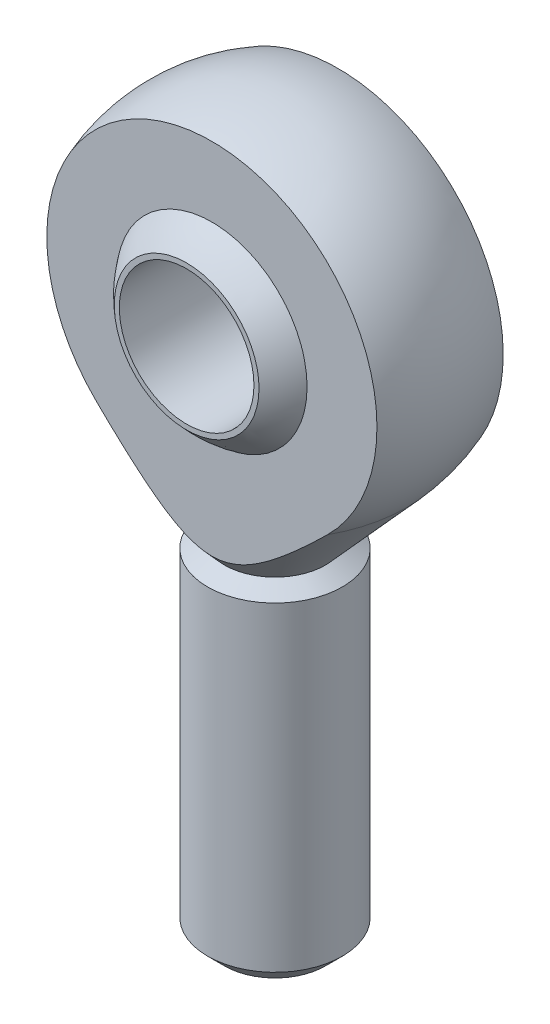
ISO-10303-21;
HEADER;
FILE_DESCRIPTION(('STEP AP214'),'2;1');
FILE_NAME('part.step','',(''),(''),'','','');
FILE_SCHEMA(('AUTOMOTIVE_DESIGN { 1 0 10303 214 1 1 1 1 }'));
ENDSEC;
DATA;
#1=APPLICATION_CONTEXT('core data for automotive mechanical design processes');
#2=APPLICATION_PROTOCOL_DEFINITION('international standard','automotive_design',2000,#1);
#3=PRODUCT_CONTEXT('',#1,'mechanical');
#4=PRODUCT('Part','Part','',(#3));
#5=PRODUCT_RELATED_PRODUCT_CATEGORY('part','',(#4));
#6=PRODUCT_DEFINITION_FORMATION('','',#4);
#7=PRODUCT_DEFINITION_CONTEXT('part definition',#1,'design');
#8=PRODUCT_DEFINITION('design','',#6,#7);
#9=PRODUCT_DEFINITION_SHAPE('','',#8);
#10=(LENGTH_UNIT() NAMED_UNIT(*) SI_UNIT(.MILLI.,.METRE.));
#11=(NAMED_UNIT(*) PLANE_ANGLE_UNIT() SI_UNIT($,.RADIAN.));
#12=(NAMED_UNIT(*) SI_UNIT($,.STERADIAN.) SOLID_ANGLE_UNIT());
#13=UNCERTAINTY_MEASURE_WITH_UNIT(LENGTH_MEASURE(1.E-05),#10,'distance_accuracy_value','');
#14=(GEOMETRIC_REPRESENTATION_CONTEXT(3) GLOBAL_UNCERTAINTY_ASSIGNED_CONTEXT((#13)) GLOBAL_UNIT_ASSIGNED_CONTEXT((#10,
#11,#12)) REPRESENTATION_CONTEXT('',''));
#15=CARTESIAN_POINT('',(0.,0.,0.));
#16=DIRECTION('',(0.,0.,1.));
#17=DIRECTION('',(1.,0.,0.));
#18=AXIS2_PLACEMENT_3D('',#15,#16,#17);
#19=CARTESIAN_POINT('',(0.,0.,0.));
#20=DIRECTION('',(0.,0.,1.));
#21=DIRECTION('',(-1.,0.,0.));
#22=AXIS2_PLACEMENT_3D('',#19,#20,#21);
#23=SPHERICAL_SURFACE('',#22,13.573125);
#24=CARTESIAN_POINT('',(0.,0.,-7.5));
#25=DIRECTION('',(0.,0.,1.));
#26=DIRECTION('',(1.,0.,0.));
#27=AXIS2_PLACEMENT_3D('',#24,#25,#26);
#28=CIRCLE('',#27,11.3128123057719);
#29=CARTESIAN_POINT('',(11.3128123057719,0.,-7.5));
#30=VERTEX_POINT('',#29);
#31=EDGE_CURVE('P0_E52',#30,#30,#28,.T.);
#32=ORIENTED_EDGE('',*,*,#31,.F.);
#33=EDGE_LOOP('',(#32));
#34=FACE_BOUND('',#33,.T.);
#35=CARTESIAN_POINT('',(0.,0.,7.5));
#36=DIRECTION('',(0.,0.,1.));
#37=DIRECTION('',(1.,0.,0.));
#38=AXIS2_PLACEMENT_3D('',#35,#36,#37);
#39=CIRCLE('',#38,11.3128123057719);
#40=CARTESIAN_POINT('',(11.3128123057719,0.,7.5));
#41=VERTEX_POINT('',#40);
#42=EDGE_CURVE('P0_E20',#41,#41,#39,.F.);
#43=ORIENTED_EDGE('',*,*,#42,.F.);
#44=EDGE_LOOP('',(#43));
#45=FACE_BOUND('',#44,.T.);
#46=ADVANCED_FACE('P0_F16',(#34,#45),#23,.F.);
#47=CARTESIAN_POINT('',(19.615045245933,-27.4229794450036,7.5));
#48=CARTESIAN_POINT('',(19.615045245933,19.615045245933,7.5));
#49=CARTESIAN_POINT('',(19.615045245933,20.0854254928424,7.5));
#50=B_SPLINE_CURVE_WITH_KNOTS('',1,(#47,#48,#49),.UNSPECIFIED.,.F.,.F.,(2,1,2),(0.,1.,1.01),.UNSPECIFIED.);
#51=DIRECTION('',(-1.,0.,0.));
#52=VECTOR('',#51,1.);
#53=SURFACE_OF_LINEAR_EXTRUSION('',#50,#52);
#54=ORIENTED_EDGE('',*,*,#42,.T.);
#55=EDGE_LOOP('',(#54));
#56=FACE_BOUND('',#55,.T.);
#57=CARTESIAN_POINT('',(0.,0.,7.5));
#58=DIRECTION('',(0.,0.,1.));
#59=DIRECTION('',(1.,0.,0.));
#60=AXIS2_PLACEMENT_3D('',#57,#58,#59);
#61=CIRCLE('',#60,19.615045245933);
#62=CARTESIAN_POINT('',(-13.7077850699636,-14.0302041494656,7.5));
#63=VERTEX_POINT('',#62);
#64=CARTESIAN_POINT('',(13.7077850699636,-14.0302041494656,7.5));
#65=VERTEX_POINT('',#64);
#66=EDGE_CURVE('P0_E47',#63,#65,#61,.F.);
#67=ORIENTED_EDGE('',*,*,#66,.F.);
#68=CARTESIAN_POINT('',(13.7077850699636,-14.0302041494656,7.5));
#69=CARTESIAN_POINT('',(13.5201011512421,-14.2135691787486,7.5));
#70=CARTESIAN_POINT('',(13.3319885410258,-14.3964967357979,7.5));
#71=CARTESIAN_POINT('',(12.9547503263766,-14.7614000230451,7.5));
#72=CARTESIAN_POINT('',(12.7656244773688,-14.9433755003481,7.5));
#73=CARTESIAN_POINT('',(12.386271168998,-15.3062314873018,7.5));
#74=CARTESIAN_POINT('',(12.196043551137,-15.4871118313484,7.5));
#75=CARTESIAN_POINT('',(11.8143748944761,-15.8476092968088,7.5));
#76=CARTESIAN_POINT('',(11.6229337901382,-16.0272263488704,7.5));
#77=CARTESIAN_POINT('',(11.2368516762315,-16.3867306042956,7.5));
#78=CARTESIAN_POINT('',(11.0421976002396,-16.5666037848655,7.5));
#79=CARTESIAN_POINT('',(10.6513449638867,-16.9246409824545,7.5));
#80=CARTESIAN_POINT('',(10.4551465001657,-17.1028051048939,7.5));
#81=CARTESIAN_POINT('',(10.0609995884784,-17.4571570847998,7.5));
#82=CARTESIAN_POINT('',(9.86305128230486,-17.6333450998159,7.5));
#83=CARTESIAN_POINT('',(9.46515388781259,-17.9834261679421,7.5));
#84=CARTESIAN_POINT('',(9.26520491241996,-18.1573193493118,7.5));
#85=CARTESIAN_POINT('',(8.81669783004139,-18.5421628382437,7.5));
#86=CARTESIAN_POINT('',(8.56754845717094,-18.7524259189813,7.5));
#87=CARTESIAN_POINT('',(8.06509071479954,-19.1679834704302,7.5));
#88=CARTESIAN_POINT('',(7.81178196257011,-19.3732774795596,7.5));
#89=CARTESIAN_POINT('',(7.3001126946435,-19.7777167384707,7.5));
#90=CARTESIAN_POINT('',(7.04175010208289,-19.9768593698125,7.5));
#91=CARTESIAN_POINT('',(6.51970723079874,-20.3667620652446,7.5));
#92=CARTESIAN_POINT('',(6.25604112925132,-20.5575410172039,7.5));
#93=CARTESIAN_POINT('',(5.72169518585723,-20.9288768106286,7.5));
#94=CARTESIAN_POINT('',(5.45101764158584,-21.1094369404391,7.5));
#95=CARTESIAN_POINT('',(4.90132851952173,-21.4571693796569,7.5));
#96=CARTESIAN_POINT('',(4.62232208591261,-21.6243497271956,7.5));
#97=CARTESIAN_POINT('',(4.13119330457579,-21.8982136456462,7.5));
#98=CARTESIAN_POINT('',(3.92138501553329,-22.0090320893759,7.5));
#99=CARTESIAN_POINT('',(3.49596072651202,-22.2190464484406,7.5));
#100=CARTESIAN_POINT('',(3.28034436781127,-22.3182416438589,7.5));
#101=CARTESIAN_POINT('',(2.84339250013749,-22.5021599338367,7.5));
#102=CARTESIAN_POINT('',(2.62206718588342,-22.5869070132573,7.5));
#103=CARTESIAN_POINT('',(2.17353927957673,-22.7390123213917,7.5));
#104=CARTESIAN_POINT('',(1.94633943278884,-22.8063785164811,7.5));
#105=CARTESIAN_POINT('',(1.52448409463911,-22.9111980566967,7.5));
#106=CARTESIAN_POINT('',(1.33060123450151,-22.951745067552,7.5));
#107=CARTESIAN_POINT('',(0.940151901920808,-23.0168263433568,7.5));
#108=CARTESIAN_POINT('',(0.743585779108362,-23.0413626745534,7.5));
#109=CARTESIAN_POINT('',(0.349313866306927,-23.0732614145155,7.5));
#110=CARTESIAN_POINT('',(0.151609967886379,-23.0806469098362,7.5));
#111=CARTESIAN_POINT('',(-0.243681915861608,-23.0779449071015,7.5));
#112=CARTESIAN_POINT('',(-0.441269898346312,-23.0678569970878,7.5));
#113=CARTESIAN_POINT('',(-0.834207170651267,-23.0307646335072,7.5));
#114=CARTESIAN_POINT('',(-1.02956151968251,-23.0038130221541,7.5));
#115=CARTESIAN_POINT('',(-1.41744209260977,-22.9342653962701,7.5));
#116=CARTESIAN_POINT('',(-1.60996813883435,-22.8916684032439,7.5));
#117=CARTESIAN_POINT('',(-1.99173123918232,-22.7924143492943,7.5));
#118=CARTESIAN_POINT('',(-2.18096098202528,-22.7357294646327,7.5));
#119=CARTESIAN_POINT('',(-2.55529723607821,-22.6102044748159,7.5));
#120=CARTESIAN_POINT('',(-2.74040383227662,-22.541364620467,7.5));
#121=CARTESIAN_POINT('',(-3.15766109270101,-22.372602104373,7.5));
#122=CARTESIAN_POINT('',(-3.38846959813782,-22.2693735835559,7.5));
#123=CARTESIAN_POINT('',(-3.84367093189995,-22.0492107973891,7.5));
#124=CARTESIAN_POINT('',(-4.0680567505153,-21.9322622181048,7.5));
#125=CARTESIAN_POINT('',(-4.5110690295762,-21.6873166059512,7.5));
#126=CARTESIAN_POINT('',(-4.72968729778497,-21.5593048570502,7.5));
#127=CARTESIAN_POINT('',(-5.16157771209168,-21.2945153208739,7.5));
#128=CARTESIAN_POINT('',(-5.37484874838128,-21.1577357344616,7.5));
#129=CARTESIAN_POINT('',(-5.7988625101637,-20.8756706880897,7.5));
#130=CARTESIAN_POINT('',(-6.00955618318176,-20.7303118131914,7.5));
#131=CARTESIAN_POINT('',(-6.42655166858,-20.433901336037,7.5));
#132=CARTESIAN_POINT('',(-6.63285786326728,-20.2828558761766,7.5));
#133=CARTESIAN_POINT('',(-7.04177902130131,-19.9760392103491,7.5));
#134=CARTESIAN_POINT('',(-7.24439551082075,-19.8202700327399,7.5));
#135=CARTESIAN_POINT('',(-7.64648838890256,-19.5047777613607,7.5));
#136=CARTESIAN_POINT('',(-7.84596507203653,-19.3450550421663,7.5));
#137=CARTESIAN_POINT('',(-8.24508039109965,-19.0199476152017,7.5));
#138=CARTESIAN_POINT('',(-8.44467943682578,-18.8545143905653,7.5));
#139=CARTESIAN_POINT('',(-8.84147600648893,-18.5207449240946,7.5));
#140=CARTESIAN_POINT('',(-9.03867321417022,-18.3524083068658,7.5));
#141=CARTESIAN_POINT('',(-9.43098412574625,-18.0132525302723,7.5));
#142=CARTESIAN_POINT('',(-9.62609742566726,-17.8424329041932,7.5));
#143=CARTESIAN_POINT('',(-10.0144974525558,-17.4986624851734,7.5));
#144=CARTESIAN_POINT('',(-10.207783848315,-17.3257113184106,7.5));
#145=CARTESIAN_POINT('',(-10.5927390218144,-16.9779746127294,7.5));
#146=CARTESIAN_POINT('',(-10.7844076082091,-16.8031888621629,7.5));
#147=CARTESIAN_POINT('',(-11.1604566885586,-16.4574070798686,7.5));
#148=CARTESIAN_POINT('',(-11.3448808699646,-16.2864585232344,7.5));
#149=CARTESIAN_POINT('',(-11.7124965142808,-15.9432753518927,7.5));
#150=CARTESIAN_POINT('',(-11.8956880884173,-15.7710408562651,7.5));
#151=CARTESIAN_POINT('',(-12.2609396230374,-15.4254638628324,7.5));
#152=CARTESIAN_POINT('',(-12.4429998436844,-15.252121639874,7.5));
#153=CARTESIAN_POINT('',(-12.8060716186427,-14.9044883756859,7.5));
#154=CARTESIAN_POINT('',(-12.9870835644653,-14.730197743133,7.5));
#155=CARTESIAN_POINT('',(-13.3481227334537,-14.3808062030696,7.5));
#156=CARTESIAN_POINT('',(-13.5281504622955,-14.2057058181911,7.5));
#157=CARTESIAN_POINT('',(-13.7077850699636,-14.0302041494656,7.5));
#158=B_SPLINE_CURVE_WITH_KNOTS('',3,(#68,#69,#70,#71,#72,#73,#74,#75,#76,#77,#78,#79,#80,#81,
#82,#83,#84,#85,#86,#87,#88,#89,#90,#91,#92,#93,#94,#95,#96,#97,#98,#99,#100,#101,#102,#103,
#104,#105,#106,#107,#108,#109,#110,#111,#112,#113,#114,#115,#116,#117,#118,#119,#120,#121,#122,
#123,#124,#125,#126,#127,#128,#129,#130,#131,#132,#133,#134,#135,#136,#137,#138,#139,#140,#141,
#142,#143,#144,#145,#146,#147,#148,#149,#150,#151,#152,#153,#154,#155,#156,#157),.UNSPECIFIED.,
.F.,.F.,(4,2,2,2,2,2,2,2,2,2,2,2,2,2,2,2,2,2,2,2,2,2,2,2,2,2,2,2,2,2,2,2,2,2,2,2,2,2,2,2,2,2,2,
2,4),(0.,0.787167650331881,1.57453473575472,2.362018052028,3.14954426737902,3.94464626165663,
4.73969889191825,5.53468767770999,6.32963184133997,7.30762431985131,8.28570729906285,
9.26420103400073,10.2403573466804,11.2161977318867,12.1914473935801,12.902993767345,
13.6145841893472,14.3249815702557,15.0350527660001,15.6286868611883,16.2222443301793,
16.8150023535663,17.4077743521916,17.9986981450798,18.5896589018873,19.1817962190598,
19.7739213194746,20.5318638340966,21.2906042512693,22.0503699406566,22.8102920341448,
23.5780835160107,24.3450682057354,25.1117280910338,25.8783156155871,26.6560184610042,
27.4338226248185,28.2117749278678,28.9898656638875,29.7680471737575,30.5224413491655,
31.2767665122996,32.0309112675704,32.784753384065,33.5381627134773),.UNSPECIFIED.);
#159=EDGE_CURVE('P0_E50',#65,#63,#158,.T.);
#160=ORIENTED_EDGE('',*,*,#159,.F.);
#161=EDGE_LOOP('',(#67,#160));
#162=FACE_BOUND('',#161,.T.);
#163=ADVANCED_FACE('P0_F49',(#56,#162),#53,.T.);
#164=CARTESIAN_POINT('',(19.615045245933,20.0854254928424,-7.5));
#165=CARTESIAN_POINT('',(19.615045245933,19.615045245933,-7.5));
#166=CARTESIAN_POINT('',(19.615045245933,-27.4229794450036,-7.5));
#167=B_SPLINE_CURVE_WITH_KNOTS('',1,(#164,#165,#166),.UNSPECIFIED.,.F.,.F.,(2,1,2),(-0.01,0.,
1.),.UNSPECIFIED.);
#168=DIRECTION('',(-1.,0.,0.));
#169=VECTOR('',#168,1.);
#170=SURFACE_OF_LINEAR_EXTRUSION('',#167,#169);
#171=ORIENTED_EDGE('',*,*,#31,.T.);
#172=EDGE_LOOP('',(#171));
#173=FACE_BOUND('',#172,.T.);
#174=CARTESIAN_POINT('',(-13.7077850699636,-14.0302041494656,-7.5));
#175=CARTESIAN_POINT('',(-13.5201011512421,-14.2135691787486,-7.5));
#176=CARTESIAN_POINT('',(-13.3319885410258,-14.3964967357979,-7.5));
#177=CARTESIAN_POINT('',(-12.9547503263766,-14.7614000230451,-7.5));
#178=CARTESIAN_POINT('',(-12.7656244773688,-14.9433755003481,-7.5));
#179=CARTESIAN_POINT('',(-12.386271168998,-15.3062314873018,-7.5));
#180=CARTESIAN_POINT('',(-12.196043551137,-15.4871118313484,-7.5));
#181=CARTESIAN_POINT('',(-11.8143748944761,-15.8476092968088,-7.5));
#182=CARTESIAN_POINT('',(-11.6229337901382,-16.0272263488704,-7.5));
#183=CARTESIAN_POINT('',(-11.2368516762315,-16.3867306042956,-7.5));
#184=CARTESIAN_POINT('',(-11.0421976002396,-16.5666037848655,-7.5));
#185=CARTESIAN_POINT('',(-10.6513449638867,-16.9246409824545,-7.5));
#186=CARTESIAN_POINT('',(-10.4551465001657,-17.1028051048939,-7.5));
#187=CARTESIAN_POINT('',(-10.0609995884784,-17.4571570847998,-7.5));
#188=CARTESIAN_POINT('',(-9.86305128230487,-17.6333450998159,-7.5));
#189=CARTESIAN_POINT('',(-9.46515388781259,-17.9834261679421,-7.5));
#190=CARTESIAN_POINT('',(-9.26520491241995,-18.1573193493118,-7.5));
#191=CARTESIAN_POINT('',(-8.81669783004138,-18.5421628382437,-7.5));
#192=CARTESIAN_POINT('',(-8.56754845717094,-18.7524259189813,-7.5));
#193=CARTESIAN_POINT('',(-8.06509071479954,-19.1679834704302,-7.5));
#194=CARTESIAN_POINT('',(-7.81178196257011,-19.3732774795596,-7.5));
#195=CARTESIAN_POINT('',(-7.3001126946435,-19.7777167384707,-7.5));
#196=CARTESIAN_POINT('',(-7.04175010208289,-19.9768593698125,-7.5));
#197=CARTESIAN_POINT('',(-6.51970723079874,-20.3667620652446,-7.5));
#198=CARTESIAN_POINT('',(-6.25604112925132,-20.5575410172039,-7.5));
#199=CARTESIAN_POINT('',(-5.72169518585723,-20.9288768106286,-7.5));
#200=CARTESIAN_POINT('',(-5.45101764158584,-21.1094369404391,-7.5));
#201=CARTESIAN_POINT('',(-4.90132851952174,-21.4571693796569,-7.5));
#202=CARTESIAN_POINT('',(-4.62232208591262,-21.6243497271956,-7.5));
#203=CARTESIAN_POINT('',(-4.1311933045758,-21.8982136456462,-7.5));
#204=CARTESIAN_POINT('',(-3.92138501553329,-22.0090320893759,-7.5));
#205=CARTESIAN_POINT('',(-3.49596072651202,-22.2190464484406,-7.5));
#206=CARTESIAN_POINT('',(-3.28034436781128,-22.3182416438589,-7.5));
#207=CARTESIAN_POINT('',(-2.8433925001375,-22.5021599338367,-7.5));
#208=CARTESIAN_POINT('',(-2.62206718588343,-22.5869070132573,-7.5));
#209=CARTESIAN_POINT('',(-2.17353927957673,-22.7390123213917,-7.5));
#210=CARTESIAN_POINT('',(-1.94633943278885,-22.8063785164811,-7.5));
#211=CARTESIAN_POINT('',(-1.52448409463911,-22.9111980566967,-7.5));
#212=CARTESIAN_POINT('',(-1.33060123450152,-22.951745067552,-7.5));
#213=CARTESIAN_POINT('',(-0.940151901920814,-23.0168263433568,-7.5));
#214=CARTESIAN_POINT('',(-0.743585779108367,-23.0413626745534,-7.5));
#215=CARTESIAN_POINT('',(-0.349313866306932,-23.0732614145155,-7.5));
#216=CARTESIAN_POINT('',(-0.151609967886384,-23.0806469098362,-7.5));
#217=CARTESIAN_POINT('',(0.243681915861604,-23.0779449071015,-7.5));
#218=CARTESIAN_POINT('',(0.441269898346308,-23.0678569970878,-7.5));
#219=CARTESIAN_POINT('',(0.834207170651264,-23.0307646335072,-7.5));
#220=CARTESIAN_POINT('',(1.0295615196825,-23.0038130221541,-7.5));
#221=CARTESIAN_POINT('',(1.41744209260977,-22.9342653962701,-7.5));
#222=CARTESIAN_POINT('',(1.60996813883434,-22.8916684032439,-7.5));
#223=CARTESIAN_POINT('',(1.99173123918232,-22.7924143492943,-7.5));
#224=CARTESIAN_POINT('',(2.18096098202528,-22.7357294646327,-7.5));
#225=CARTESIAN_POINT('',(2.55529723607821,-22.6102044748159,-7.5));
#226=CARTESIAN_POINT('',(2.74040383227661,-22.541364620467,-7.5));
#227=CARTESIAN_POINT('',(3.15766109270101,-22.372602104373,-7.5));
#228=CARTESIAN_POINT('',(3.38846959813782,-22.2693735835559,-7.5));
#229=CARTESIAN_POINT('',(3.84367093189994,-22.0492107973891,-7.5));
#230=CARTESIAN_POINT('',(4.06805675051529,-21.9322622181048,-7.5));
#231=CARTESIAN_POINT('',(4.51106902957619,-21.6873166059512,-7.5));
#232=CARTESIAN_POINT('',(4.72968729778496,-21.5593048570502,-7.5));
#233=CARTESIAN_POINT('',(5.16157771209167,-21.294515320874,-7.5));
#234=CARTESIAN_POINT('',(5.37484874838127,-21.1577357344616,-7.5));
#235=CARTESIAN_POINT('',(5.79886251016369,-20.8756706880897,-7.5));
#236=CARTESIAN_POINT('',(6.00955618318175,-20.7303118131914,-7.5));
#237=CARTESIAN_POINT('',(6.42655166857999,-20.433901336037,-7.5));
#238=CARTESIAN_POINT('',(6.63285786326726,-20.2828558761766,-7.5));
#239=CARTESIAN_POINT('',(7.04177902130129,-19.9760392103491,-7.5));
#240=CARTESIAN_POINT('',(7.24439551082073,-19.82027003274,-7.5));
#241=CARTESIAN_POINT('',(7.64648838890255,-19.5047777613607,-7.5));
#242=CARTESIAN_POINT('',(7.84596507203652,-19.3450550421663,-7.5));
#243=CARTESIAN_POINT('',(8.24508039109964,-19.0199476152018,-7.5));
#244=CARTESIAN_POINT('',(8.44467943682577,-18.8545143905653,-7.5));
#245=CARTESIAN_POINT('',(8.84147600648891,-18.5207449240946,-7.5));
#246=CARTESIAN_POINT('',(9.0386732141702,-18.3524083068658,-7.5));
#247=CARTESIAN_POINT('',(9.43098412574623,-18.0132525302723,-7.5));
#248=CARTESIAN_POINT('',(9.62609742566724,-17.8424329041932,-7.5));
#249=CARTESIAN_POINT('',(10.0144974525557,-17.4986624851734,-7.5));
#250=CARTESIAN_POINT('',(10.207783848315,-17.3257113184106,-7.5));
#251=CARTESIAN_POINT('',(10.5927390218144,-16.9779746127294,-7.5));
#252=CARTESIAN_POINT('',(10.784407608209,-16.8031888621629,-7.5));
#253=CARTESIAN_POINT('',(11.1604566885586,-16.4574070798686,-7.5));
#254=CARTESIAN_POINT('',(11.3448808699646,-16.2864585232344,-7.5));
#255=CARTESIAN_POINT('',(11.7124965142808,-15.9432753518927,-7.5));
#256=CARTESIAN_POINT('',(11.8956880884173,-15.7710408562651,-7.5));
#257=CARTESIAN_POINT('',(12.2609396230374,-15.4254638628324,-7.5));
#258=CARTESIAN_POINT('',(12.4429998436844,-15.252121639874,-7.5));
#259=CARTESIAN_POINT('',(12.8060716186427,-14.9044883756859,-7.5));
#260=CARTESIAN_POINT('',(12.9870835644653,-14.730197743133,-7.5));
#261=CARTESIAN_POINT('',(13.3481227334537,-14.3808062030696,-7.5));
#262=CARTESIAN_POINT('',(13.5281504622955,-14.205705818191,-7.5));
#263=CARTESIAN_POINT('',(13.7077850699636,-14.0302041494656,-7.5));
#264=B_SPLINE_CURVE_WITH_KNOTS('',3,(#174,#175,#176,#177,#178,#179,#180,#181,#182,#183,#184,
#185,#186,#187,#188,#189,#190,#191,#192,#193,#194,#195,#196,#197,#198,#199,#200,#201,#202,#203,
#204,#205,#206,#207,#208,#209,#210,#211,#212,#213,#214,#215,#216,#217,#218,#219,#220,#221,#222,
#223,#224,#225,#226,#227,#228,#229,#230,#231,#232,#233,#234,#235,#236,#237,#238,#239,#240,#241,
#242,#243,#244,#245,#246,#247,#248,#249,#250,#251,#252,#253,#254,#255,#256,#257,#258,#259,#260,
#261,#262,#263),.UNSPECIFIED.,.F.,.F.,(4,2,2,2,2,2,2,2,2,2,2,2,2,2,2,2,2,2,2,2,2,2,2,2,2,2,2,2,
2,2,2,2,2,2,2,2,2,2,2,2,2,2,2,2,4),(0.,0.787167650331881,1.57453473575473,2.362018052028,
3.14954426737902,3.94464626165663,4.73969889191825,5.53468767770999,6.32963184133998,
7.30762431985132,8.28570729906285,9.26420103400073,10.2403573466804,11.2161977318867,
12.1914473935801,12.902993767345,13.6145841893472,14.3249815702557,15.0350527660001,
15.6286868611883,16.2222443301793,16.8150023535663,17.4077743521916,17.9986981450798,
18.5896589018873,19.1817962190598,19.7739213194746,20.5318638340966,21.2906042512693,
22.0503699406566,22.8102920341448,23.5780835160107,24.3450682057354,25.1117280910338,
25.8783156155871,26.6560184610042,27.4338226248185,28.2117749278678,28.9898656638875,
29.7680471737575,30.5224413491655,31.2767665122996,32.0309112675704,32.784753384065,
33.5381627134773),.UNSPECIFIED.);
#265=CARTESIAN_POINT('',(-13.7077850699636,-14.0302041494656,-7.5));
#266=VERTEX_POINT('',#265);
#267=CARTESIAN_POINT('',(13.7077850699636,-14.0302041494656,-7.5));
#268=VERTEX_POINT('',#267);
#269=EDGE_CURVE('P0_E57',#266,#268,#264,.T.);
#270=ORIENTED_EDGE('',*,*,#269,.F.);
#271=CARTESIAN_POINT('',(0.,0.,-7.49999999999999));
#272=DIRECTION('',(0.,0.,1.));
#273=DIRECTION('',(1.,0.,0.));
#274=AXIS2_PLACEMENT_3D('',#271,#272,#273);
#275=CIRCLE('',#274,19.615045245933);
#276=EDGE_CURVE('P0_E34',#268,#266,#275,.T.);
#277=ORIENTED_EDGE('',*,*,#276,.F.);
#278=EDGE_LOOP('',(#270,#277));
#279=FACE_BOUND('',#278,.T.);
#280=ADVANCED_FACE('P0_F75',(#173,#279),#170,.T.);
#281=CARTESIAN_POINT('',(0.,0.,0.));
#282=DIRECTION('',(0.,0.,1.));
#283=DIRECTION('',(1.,0.,0.));
#284=AXIS2_PLACEMENT_3D('',#281,#282,#283);
#285=SPHERICAL_SURFACE('',#284,21.);
#286=CARTESIAN_POINT('',(0.,-14.0302041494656,0.));
#287=DIRECTION('',(0.,1.,0.));
#288=DIRECTION('',(0.,0.,1.));
#289=AXIS2_PLACEMENT_3D('',#286,#287,#288);
#290=CIRCLE('',#289,15.6254078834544);
#291=EDGE_CURVE('P0_E42',#268,#65,#290,.F.);
#292=ORIENTED_EDGE('',*,*,#291,.F.);
#293=ORIENTED_EDGE('',*,*,#276,.T.);
#294=CARTESIAN_POINT('',(0.,-14.0302041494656,0.));
#295=DIRECTION('',(0.,1.,0.));
#296=DIRECTION('',(0.,0.,1.));
#297=AXIS2_PLACEMENT_3D('',#294,#295,#296);
#298=CIRCLE('',#297,15.6254078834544);
#299=EDGE_CURVE('P0_E55',#63,#266,#298,.F.);
#300=ORIENTED_EDGE('',*,*,#299,.F.);
#301=ORIENTED_EDGE('',*,*,#66,.T.);
#302=EDGE_LOOP('',(#292,#293,#300,#301));
#303=FACE_BOUND('',#302,.T.);
#304=ADVANCED_FACE('P0_F56',(#303),#285,.T.);
#305=CARTESIAN_POINT('',(0.,-24.75,0.));
#306=DIRECTION('',(0.,1.,0.));
#307=DIRECTION('',(0.,0.,1.));
#308=AXIS2_PLACEMENT_3D('',#305,#306,#307);
#309=CONICAL_SURFACE('',#308,6.,0.731658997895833);
#310=ORIENTED_EDGE('',*,*,#159,.T.);
#311=ORIENTED_EDGE('',*,*,#299,.T.);
#312=ORIENTED_EDGE('',*,*,#269,.T.);
#313=ORIENTED_EDGE('',*,*,#291,.T.);
#314=EDGE_LOOP('',(#310,#311,#312,#313));
#315=FACE_BOUND('',#314,.T.);
#316=CARTESIAN_POINT('',(0.,-24.75,0.));
#317=DIRECTION('',(0.,1.,0.));
#318=DIRECTION('',(0.,0.,1.));
#319=AXIS2_PLACEMENT_3D('',#316,#317,#318);
#320=CIRCLE('',#319,6.);
#321=CARTESIAN_POINT('',(0.,-24.75,6.));
#322=VERTEX_POINT('',#321);
#323=EDGE_CURVE('P0_E91',#322,#322,#320,.F.);
#324=ORIENTED_EDGE('',*,*,#323,.F.);
#325=EDGE_LOOP('',(#324));
#326=FACE_BOUND('',#325,.T.);
#327=ADVANCED_FACE('P0_F59',(#315,#326),#309,.T.);
#328=CARTESIAN_POINT('',(0.,-24.75,0.));
#329=DIRECTION('',(0.,-1.,0.));
#330=DIRECTION('',(1.,0.,0.));
#331=AXIS2_PLACEMENT_3D('',#328,#329,#330);
#332=CONICAL_SURFACE('',#331,6.,1.01219701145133);
#333=ORIENTED_EDGE('',*,*,#323,.T.);
#334=EDGE_LOOP('',(#333));
#335=FACE_BOUND('',#334,.T.);
#336=CARTESIAN_POINT('',(0.,-26.,0.));
#337=DIRECTION('',(0.,-1.,0.));
#338=DIRECTION('',(0.,0.,1.));
#339=AXIS2_PLACEMENT_3D('',#336,#337,#338);
#340=CIRCLE('',#339,8.);
#341=CARTESIAN_POINT('',(0.,-26.,8.));
#342=VERTEX_POINT('',#341);
#343=EDGE_CURVE('P0_E132',#342,#342,#340,.T.);
#344=ORIENTED_EDGE('',*,*,#343,.F.);
#345=EDGE_LOOP('',(#344));
#346=FACE_BOUND('',#345,.T.);
#347=ADVANCED_FACE('P0_F119',(#335,#346),#332,.T.);
#348=CARTESIAN_POINT('',(0.,-64.,0.));
#349=DIRECTION('',(0.,-1.,0.));
#350=DIRECTION('',(0.,0.,-1.));
#351=AXIS2_PLACEMENT_3D('',#348,#349,#350);
#352=CYLINDRICAL_SURFACE('',#351,8.);
#353=ORIENTED_EDGE('',*,*,#343,.T.);
#354=EDGE_LOOP('',(#353));
#355=FACE_BOUND('',#354,.T.);
#356=CARTESIAN_POINT('',(0.,-64.,0.));
#357=DIRECTION('',(0.,-1.,0.));
#358=DIRECTION('',(0.,0.,1.));
#359=AXIS2_PLACEMENT_3D('',#356,#357,#358);
#360=CIRCLE('',#359,7.99999999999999);
#361=CARTESIAN_POINT('',(0.,-64.,7.99999999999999));
#362=VERTEX_POINT('',#361);
#363=EDGE_CURVE('P0_E26',#362,#362,#360,.T.);
#364=ORIENTED_EDGE('',*,*,#363,.F.);
#365=EDGE_LOOP('',(#364));
#366=FACE_BOUND('',#365,.T.);
#367=ADVANCED_FACE('P0_F112',(#355,#366),#352,.T.);
#368=CARTESIAN_POINT('',(6.07200210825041,-66.,-6.));
#369=DIRECTION('',(0.,-1.,0.));
#370=DIRECTION('',(0.,0.,1.));
#371=AXIS2_PLACEMENT_3D('',#368,#369,#370);
#372=PLANE('',#371);
#373=CARTESIAN_POINT('',(0.,-66.,0.));
#374=DIRECTION('',(0.,1.,0.));
#375=DIRECTION('',(0.,0.,1.));
#376=AXIS2_PLACEMENT_3D('',#373,#374,#375);
#377=CIRCLE('',#376,6.);
#378=CARTESIAN_POINT('',(0.,-66.,6.));
#379=VERTEX_POINT('',#378);
#380=EDGE_CURVE('P0_E11',#379,#379,#377,.T.);
#381=ORIENTED_EDGE('',*,*,#380,.F.);
#382=EDGE_LOOP('',(#381));
#383=FACE_BOUND('',#382,.T.);
#384=ADVANCED_FACE('P0_F105',(#383),#372,.T.);
#385=CARTESIAN_POINT('',(0.,-66.,0.));
#386=DIRECTION('',(0.,1.,0.));
#387=DIRECTION('',(0.,0.,1.));
#388=AXIS2_PLACEMENT_3D('',#385,#386,#387);
#389=CONICAL_SURFACE('',#388,6.,0.785398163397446);
#390=ORIENTED_EDGE('',*,*,#363,.T.);
#391=EDGE_LOOP('',(#390));
#392=FACE_BOUND('',#391,.T.);
#393=ORIENTED_EDGE('',*,*,#380,.T.);
#394=EDGE_LOOP('',(#393));
#395=FACE_BOUND('',#394,.T.);
#396=ADVANCED_FACE('P0_F103',(#392,#395),#389,.T.);
#397=CLOSED_SHELL('',(#46,#163,#280,#304,#327,#347,#367,#384,#396));
#398=MANIFOLD_SOLID_BREP('P0_B1',#397);
#399=CARTESIAN_POINT('',(0.,0.,-10.5));
#400=DIRECTION('',(0.,0.,1.));
#401=DIRECTION('',(1.,0.,0.));
#402=AXIS2_PLACEMENT_3D('',#399,#400,#401);
#403=CYLINDRICAL_SURFACE('',#402,8.);
#404=CARTESIAN_POINT('',(0.,0.,10.5));
#405=DIRECTION('',(0.,0.,1.));
#406=DIRECTION('',(1.,0.,0.));
#407=AXIS2_PLACEMENT_3D('',#404,#405,#406);
#408=CIRCLE('',#407,8.);
#409=CARTESIAN_POINT('',(8.,0.,10.5));
#410=VERTEX_POINT('',#409);
#411=EDGE_CURVE('P1_E18',#410,#410,#408,.F.);
#412=ORIENTED_EDGE('',*,*,#411,.F.);
#413=EDGE_LOOP('',(#412));
#414=FACE_BOUND('',#413,.T.);
#415=CARTESIAN_POINT('',(0.,0.,-10.5));
#416=DIRECTION('',(0.,0.,1.));
#417=DIRECTION('',(1.,0.,0.));
#418=AXIS2_PLACEMENT_3D('',#415,#416,#417);
#419=CIRCLE('',#418,8.);
#420=CARTESIAN_POINT('',(8.,0.,-10.5));
#421=VERTEX_POINT('',#420);
#422=EDGE_CURVE('P1_E71',#421,#421,#419,.T.);
#423=ORIENTED_EDGE('',*,*,#422,.F.);
#424=EDGE_LOOP('',(#423));
#425=FACE_BOUND('',#424,.T.);
#426=ADVANCED_FACE('P1_F15',(#414,#425),#403,.F.);
#427=CARTESIAN_POINT('',(-8.60114656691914,8.77488972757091,10.5));
#428=CARTESIAN_POINT('',(-8.60114656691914,8.60114656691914,10.5));
#429=CARTESIAN_POINT('',(-8.60114656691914,-8.60114656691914,10.5));
#430=CARTESIAN_POINT('',(-8.60114656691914,-8.77316949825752,10.5));
#431=B_SPLINE_CURVE_WITH_KNOTS('',1,(#427,#428,#429,#430),.UNSPECIFIED.,.F.,.F.,(2,1,1,2),
(-0.0101,0.,1.,1.01),.UNSPECIFIED.);
#432=DIRECTION('',(1.,0.,0.));
#433=VECTOR('',#432,1.);
#434=SURFACE_OF_LINEAR_EXTRUSION('',#431,#433);
#435=ORIENTED_EDGE('',*,*,#411,.T.);
#436=EDGE_LOOP('',(#435));
#437=FACE_BOUND('',#436,.T.);
#438=CARTESIAN_POINT('',(8.60114656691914,0.,10.5));
#439=CARTESIAN_POINT('',(8.60114523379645,-0.241492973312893,10.5));
#440=CARTESIAN_POINT('',(8.59096751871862,-0.483029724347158,10.5));
#441=CARTESIAN_POINT('',(8.55031966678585,-0.964437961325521,10.5));
#442=CARTESIAN_POINT('',(8.51984353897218,-1.20430893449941,10.5));
#443=CARTESIAN_POINT('',(8.4387461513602,-1.68102031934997,10.5));
#444=CARTESIAN_POINT('',(8.38809291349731,-1.91785530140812,10.5));
#445=CARTESIAN_POINT('',(8.26695263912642,-2.38660131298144,10.5));
#446=CARTESIAN_POINT('',(8.1964495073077,-2.61850818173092,10.5));
#447=CARTESIAN_POINT('',(8.03626761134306,-3.07515357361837,10.5));
#448=CARTESIAN_POINT('',(7.94662207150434,-3.29990375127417,10.5));
#449=CARTESIAN_POINT('',(7.74867577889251,-3.74115543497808,10.5));
#450=CARTESIAN_POINT('',(7.64036659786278,-3.95765316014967,10.5));
#451=CARTESIAN_POINT('',(7.40588695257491,-4.38076054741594,10.5));
#452=CARTESIAN_POINT('',(7.27971581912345,-4.58736983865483,10.5));
#453=CARTESIAN_POINT('',(7.01047366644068,-4.98913127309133,10.5));
#454=CARTESIAN_POINT('',(6.86741030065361,-5.18428854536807,10.5));
#455=CARTESIAN_POINT('',(6.56525705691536,-5.56198228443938,10.5));
#456=CARTESIAN_POINT('',(6.40615688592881,-5.74451051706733,10.5));
#457=CARTESIAN_POINT('',(6.07330002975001,-6.09533932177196,10.5));
#458=CARTESIAN_POINT('',(5.8995576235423,-6.26365344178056,10.5));
#459=CARTESIAN_POINT('',(5.538436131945,-6.58512813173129,10.5));
#460=CARTESIAN_POINT('',(5.35105090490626,-6.73828180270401,10.5));
#461=CARTESIAN_POINT('',(4.96400052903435,-7.02829376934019,10.5));
#462=CARTESIAN_POINT('',(4.76433254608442,-7.16514828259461,10.5));
#463=CARTESIAN_POINT('',(4.35420871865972,-7.42152694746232,10.5));
#464=CARTESIAN_POINT('',(4.14375460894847,-7.54105387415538,10.5));
#465=CARTESIAN_POINT('',(3.71352234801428,-7.76195523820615,10.5));
#466=CARTESIAN_POINT('',(3.49374407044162,-7.86332942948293,10.5));
#467=CARTESIAN_POINT('',(3.0464338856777,-8.04720046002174,10.5));
#468=CARTESIAN_POINT('',(2.81890215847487,-8.12969773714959,10.5));
#469=CARTESIAN_POINT('',(2.35769514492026,-8.2752322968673,10.5));
#470=CARTESIAN_POINT('',(2.1240197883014,-8.33826935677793,10.5));
#471=CARTESIAN_POINT('',(1.65223965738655,-8.4444227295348,10.5));
#472=CARTESIAN_POINT('',(1.41413583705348,-8.48754328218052,10.5));
#473=CARTESIAN_POINT('',(0.935040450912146,-8.55359106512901,10.5));
#474=CARTESIAN_POINT('',(0.69404770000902,-8.57650969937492,10.5));
#475=CARTESIAN_POINT('',(0.210988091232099,-8.60195936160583,10.5));
#476=CARTESIAN_POINT('',(-0.031078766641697,-8.60449038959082,10.5));
#477=CARTESIAN_POINT('',(-0.51446202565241,-8.58915013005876,10.5));
#478=CARTESIAN_POINT('',(-0.755778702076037,-8.57128751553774,10.5));
#479=CARTESIAN_POINT('',(-1.23610137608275,-8.51529502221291,10.5));
#480=CARTESIAN_POINT('',(-1.47510687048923,-8.47716082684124,10.5));
#481=CARTESIAN_POINT('',(-1.9490530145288,-8.38089416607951,10.5));
#482=CARTESIAN_POINT('',(-2.18399371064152,-8.32276192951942,10.5));
#483=CARTESIAN_POINT('',(-2.64814823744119,-8.18691078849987,10.5));
#484=CARTESIAN_POINT('',(-2.87736193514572,-8.10919142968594,10.5));
#485=CARTESIAN_POINT('',(-3.32842411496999,-7.9347204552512,10.5));
#486=CARTESIAN_POINT('',(-3.55027269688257,-7.83796909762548,10.5));
#487=CARTESIAN_POINT('',(-3.98506560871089,-7.62610428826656,10.5));
#488=CARTESIAN_POINT('',(-4.19800850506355,-7.51098789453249,10.5));
#489=CARTESIAN_POINT('',(-4.61338978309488,-7.26325148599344,10.5));
#490=CARTESIAN_POINT('',(-4.81583058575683,-7.13063553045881,10.5));
#491=CARTESIAN_POINT('',(-5.20873252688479,-6.84888604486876,10.5));
#492=CARTESIAN_POINT('',(-5.39919904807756,-6.69976002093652,10.5));
#493=CARTESIAN_POINT('',(-5.76707726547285,-6.38584896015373,10.5));
#494=CARTESIAN_POINT('',(-5.94447618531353,-6.22104894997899,10.5));
#495=CARTESIAN_POINT('',(-6.28464364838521,-5.87719543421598,10.5));
#496=CARTESIAN_POINT('',(-6.44742156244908,-5.69815119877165,10.5));
#497=CARTESIAN_POINT('',(-6.75738908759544,-5.3269050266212,10.5));
#498=CARTESIAN_POINT('',(-6.90457162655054,-5.13469718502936,10.5));
#499=CARTESIAN_POINT('',(-7.1822120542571,-4.7385704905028,10.5));
#500=CARTESIAN_POINT('',(-7.31267056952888,-4.53465207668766,10.5));
#501=CARTESIAN_POINT('',(-7.55588643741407,-4.11664271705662,10.5));
#502=CARTESIAN_POINT('',(-7.66865177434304,-3.90255641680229,10.5));
#503=CARTESIAN_POINT('',(-7.87592982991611,-3.46527039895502,10.5));
#504=CARTESIAN_POINT('',(-7.97041073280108,-3.24205560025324,10.5));
#505=CARTESIAN_POINT('',(-8.14013479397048,-2.78863357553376,10.5));
#506=CARTESIAN_POINT('',(-8.21539352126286,-2.55843217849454,10.5));
#507=CARTESIAN_POINT('',(-8.34613334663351,-2.09288129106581,10.5));
#508=CARTESIAN_POINT('',(-8.40164567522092,-1.85754056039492,10.5));
#509=CARTESIAN_POINT('',(-8.49265342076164,-1.3830685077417,10.5));
#510=CARTESIAN_POINT('',(-8.52815474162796,-1.14393832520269,10.5));
#511=CARTESIAN_POINT('',(-8.56939049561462,-0.753697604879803,10.5));
#512=CARTESIAN_POINT('',(-8.58129530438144,-0.603212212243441,10.5));
#513=CARTESIAN_POINT('',(-8.59717375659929,-0.301823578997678,10.5));
#514=CARTESIAN_POINT('',(-8.60114740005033,-0.150920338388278,10.5));
#515=CARTESIAN_POINT('',(-8.60114523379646,0.24149297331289,10.5));
#516=CARTESIAN_POINT('',(-8.59096751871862,0.483029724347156,10.5));
#517=CARTESIAN_POINT('',(-8.55031966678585,0.964437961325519,10.5));
#518=CARTESIAN_POINT('',(-8.51984353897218,1.20430893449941,10.5));
#519=CARTESIAN_POINT('',(-8.4387461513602,1.68102031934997,10.5));
#520=CARTESIAN_POINT('',(-8.38809291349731,1.91785530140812,10.5));
#521=CARTESIAN_POINT('',(-8.26695263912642,2.38660131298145,10.5));
#522=CARTESIAN_POINT('',(-8.1964495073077,2.61850818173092,10.5));
#523=CARTESIAN_POINT('',(-8.03626761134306,3.07515357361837,10.5));
#524=CARTESIAN_POINT('',(-7.94662207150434,3.29990375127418,10.5));
#525=CARTESIAN_POINT('',(-7.74867577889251,3.74115543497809,10.5));
#526=CARTESIAN_POINT('',(-7.64036659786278,3.95765316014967,10.5));
#527=CARTESIAN_POINT('',(-7.4058869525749,4.38076054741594,10.5));
#528=CARTESIAN_POINT('',(-7.27971581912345,4.58736983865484,10.5));
#529=CARTESIAN_POINT('',(-7.01047366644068,4.98913127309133,10.5));
#530=CARTESIAN_POINT('',(-6.8674103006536,5.18428854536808,10.5));
#531=CARTESIAN_POINT('',(-6.56525705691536,5.56198228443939,10.5));
#532=CARTESIAN_POINT('',(-6.40615688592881,5.74451051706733,10.5));
#533=CARTESIAN_POINT('',(-6.07330002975,6.09533932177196,10.5));
#534=CARTESIAN_POINT('',(-5.8995576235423,6.26365344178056,10.5));
#535=CARTESIAN_POINT('',(-5.53843613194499,6.58512813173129,10.5));
#536=CARTESIAN_POINT('',(-5.35105090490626,6.73828180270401,10.5));
#537=CARTESIAN_POINT('',(-4.96400052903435,7.02829376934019,10.5));
#538=CARTESIAN_POINT('',(-4.76433254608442,7.16514828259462,10.5));
#539=CARTESIAN_POINT('',(-4.35420871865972,7.42152694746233,10.5));
#540=CARTESIAN_POINT('',(-4.14375460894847,7.54105387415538,10.5));
#541=CARTESIAN_POINT('',(-3.71352234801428,7.76195523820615,10.5));
#542=CARTESIAN_POINT('',(-3.49374407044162,7.86332942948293,10.5));
#543=CARTESIAN_POINT('',(-3.04643388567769,8.04720046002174,10.5));
#544=CARTESIAN_POINT('',(-2.81890215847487,8.12969773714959,10.5));
#545=CARTESIAN_POINT('',(-2.35769514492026,8.27523229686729,10.5));
#546=CARTESIAN_POINT('',(-2.12401978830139,8.33826935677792,10.5));
#547=CARTESIAN_POINT('',(-1.65223965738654,8.4444227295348,10.5));
#548=CARTESIAN_POINT('',(-1.41413583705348,8.48754328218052,10.5));
#549=CARTESIAN_POINT('',(-0.935040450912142,8.55359106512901,10.5));
#550=CARTESIAN_POINT('',(-0.694047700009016,8.57650969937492,10.5));
#551=CARTESIAN_POINT('',(-0.210988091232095,8.60195936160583,10.5));
#552=CARTESIAN_POINT('',(0.0310787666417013,8.60449038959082,10.5));
#553=CARTESIAN_POINT('',(0.514462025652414,8.58915013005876,10.5));
#554=CARTESIAN_POINT('',(0.755778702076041,8.57128751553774,10.5));
#555=CARTESIAN_POINT('',(1.23610137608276,8.51529502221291,10.5));
#556=CARTESIAN_POINT('',(1.47510687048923,8.47716082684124,10.5));
#557=CARTESIAN_POINT('',(1.9490530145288,8.38089416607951,10.5));
#558=CARTESIAN_POINT('',(2.18399371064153,8.32276192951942,10.5));
#559=CARTESIAN_POINT('',(2.6481482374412,8.18691078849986,10.5));
#560=CARTESIAN_POINT('',(2.87736193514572,8.10919142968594,10.5));
#561=CARTESIAN_POINT('',(3.32842411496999,7.9347204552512,10.5));
#562=CARTESIAN_POINT('',(3.55027269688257,7.83796909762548,10.5));
#563=CARTESIAN_POINT('',(3.98506560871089,7.62610428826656,10.5));
#564=CARTESIAN_POINT('',(4.19800850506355,7.51098789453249,10.5));
#565=CARTESIAN_POINT('',(4.61338978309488,7.26325148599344,10.5));
#566=CARTESIAN_POINT('',(4.81583058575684,7.13063553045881,10.5));
#567=CARTESIAN_POINT('',(5.20873252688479,6.84888604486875,10.5));
#568=CARTESIAN_POINT('',(5.39919904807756,6.69976002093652,10.5));
#569=CARTESIAN_POINT('',(5.76707726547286,6.38584896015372,10.5));
#570=CARTESIAN_POINT('',(5.94447618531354,6.22104894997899,10.5));
#571=CARTESIAN_POINT('',(6.28464364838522,5.87719543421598,10.5));
#572=CARTESIAN_POINT('',(6.44742156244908,5.69815119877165,10.5));
#573=CARTESIAN_POINT('',(6.75738908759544,5.3269050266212,10.5));
#574=CARTESIAN_POINT('',(6.90457162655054,5.13469718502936,10.5));
#575=CARTESIAN_POINT('',(7.1822120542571,4.7385704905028,10.5));
#576=CARTESIAN_POINT('',(7.31267056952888,4.53465207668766,10.5));
#577=CARTESIAN_POINT('',(7.55588643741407,4.11664271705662,10.5));
#578=CARTESIAN_POINT('',(7.66865177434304,3.90255641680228,10.5));
#579=CARTESIAN_POINT('',(7.87592982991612,3.46527039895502,10.5));
#580=CARTESIAN_POINT('',(7.97041073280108,3.24205560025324,10.5));
#581=CARTESIAN_POINT('',(8.14013479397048,2.78863357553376,10.5));
#582=CARTESIAN_POINT('',(8.21539352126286,2.55843217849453,10.5));
#583=CARTESIAN_POINT('',(8.34613334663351,2.0928812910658,10.5));
#584=CARTESIAN_POINT('',(8.40164567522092,1.85754056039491,10.5));
#585=CARTESIAN_POINT('',(8.49265342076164,1.38306850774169,10.5));
#586=CARTESIAN_POINT('',(8.52815474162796,1.14393832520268,10.5));
#587=CARTESIAN_POINT('',(8.56939049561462,0.753697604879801,10.5));
#588=CARTESIAN_POINT('',(8.58129530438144,0.603212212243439,10.5));
#589=CARTESIAN_POINT('',(8.5971737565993,0.301823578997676,10.5));
#590=CARTESIAN_POINT('',(8.60114740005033,0.150920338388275,10.5));
#591=CARTESIAN_POINT('',(8.60114656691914,0.,10.5));
#592=B_SPLINE_CURVE_WITH_KNOTS('',3,(#438,#439,#440,#441,#442,#443,#444,#445,#446,#447,#448,
#449,#450,#451,#452,#453,#454,#455,#456,#457,#458,#459,#460,#461,#462,#463,#464,#465,#466,#467,
#468,#469,#470,#471,#472,#473,#474,#475,#476,#477,#478,#479,#480,#481,#482,#483,#484,#485,#486,
#487,#488,#489,#490,#491,#492,#493,#494,#495,#496,#497,#498,#499,#500,#501,#502,#503,#504,#505,
#506,#507,#508,#509,#510,#511,#512,#513,#514,#515,#516,#517,#518,#519,#520,#521,#522,#523,#524,
#525,#526,#527,#528,#529,#530,#531,#532,#533,#534,#535,#536,#537,#538,#539,#540,#541,#542,#543,
#544,#545,#546,#547,#548,#549,#550,#551,#552,#553,#554,#555,#556,#557,#558,#559,#560,#561,#562,
#563,#564,#565,#566,#567,#568,#569,#570,#571,#572,#573,#574,#575,#576,#577,#578,#579,#580,#581,
#582,#583,#584,#585,#586,#587,#588,#589,#590,#591),.UNSPECIFIED.,.T.,.F.,(4,2,2,2,2,2,2,2,2,2,2,
2,2,2,2,2,2,2,2,2,2,2,2,2,2,2,2,2,2,2,2,2,2,2,2,2,2,2,2,2,2,2,2,2,2,2,2,2,2,2,2,2,2,2,2,2,2,2,2,
2,2,2,2,2,2,2,2,2,2,2,2,2,2,2,2,2,4),(0.,0.72434073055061,1.44889534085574,2.17460287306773,
2.90090054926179,3.62594773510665,4.35132320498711,5.07672585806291,5.80180110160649,
6.52734472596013,7.2521888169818,7.97736125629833,8.70270165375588,9.42792575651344,
10.1531596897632,10.8783767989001,11.6036022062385,12.328673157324,13.0540524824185,
13.779431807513,14.5045027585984,15.2297281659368,15.9549452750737,16.6801792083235,
17.405403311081,18.1307437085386,18.8559161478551,19.5807602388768,20.3063038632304,
21.031379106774,21.7567817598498,22.4821572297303,23.2072044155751,23.9335020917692,
24.6592096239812,25.3837642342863,26.1081049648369,26.5607796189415,27.0134542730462,
27.7377950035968,28.4623496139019,29.1880571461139,29.914354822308,30.6394020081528,
31.3647774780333,32.0901801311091,32.8152553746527,33.5407989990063,34.265643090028,
34.9908155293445,35.716155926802,36.4413800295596,37.1666139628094,37.8918310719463,
38.6170564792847,39.3421274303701,40.0675067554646,40.7928860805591,41.5179570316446,
42.243182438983,42.9683995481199,43.6936334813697,44.4188575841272,45.1441979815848,
45.8693704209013,46.5942145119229,47.3197581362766,48.0448333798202,48.770236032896,
49.4956115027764,50.2206586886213,50.9469563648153,51.6726638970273,52.3972185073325,
53.1215592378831,53.5742338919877,54.0269085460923),.UNSPECIFIED.);
#593=CARTESIAN_POINT('',(8.60114656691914,0.,10.5));
#594=VERTEX_POINT('',#593);
#595=EDGE_CURVE('P1_E24',#594,#594,#592,.T.);
#596=ORIENTED_EDGE('',*,*,#595,.F.);
#597=EDGE_LOOP('',(#596));
#598=FACE_BOUND('',#597,.T.);
#599=ADVANCED_FACE('P1_F40',(#437,#598),#434,.T.);
#600=CARTESIAN_POINT('',(-8.60114656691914,-8.77316949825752,-10.5));
#601=CARTESIAN_POINT('',(-8.60114656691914,-8.60114656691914,-10.5));
#602=CARTESIAN_POINT('',(-8.60114656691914,8.60114656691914,-10.5));
#603=CARTESIAN_POINT('',(-8.60114656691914,8.77488972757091,-10.5));
#604=B_SPLINE_CURVE_WITH_KNOTS('',1,(#600,#601,#602,#603),.UNSPECIFIED.,.F.,.F.,(2,1,1,2),
(-0.01,0.,1.,1.0101),.UNSPECIFIED.);
#605=DIRECTION('',(1.,0.,0.));
#606=VECTOR('',#605,1.);
#607=SURFACE_OF_LINEAR_EXTRUSION('',#604,#606);
#608=ORIENTED_EDGE('',*,*,#422,.T.);
#609=EDGE_LOOP('',(#608));
#610=FACE_BOUND('',#609,.T.);
#611=CARTESIAN_POINT('',(-8.60114656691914,0.,-10.5));
#612=CARTESIAN_POINT('',(-8.60114523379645,-0.241492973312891,-10.5));
#613=CARTESIAN_POINT('',(-8.59096751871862,-0.483029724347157,-10.5));
#614=CARTESIAN_POINT('',(-8.55031966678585,-0.964437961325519,-10.5));
#615=CARTESIAN_POINT('',(-8.51984353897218,-1.20430893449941,-10.5));
#616=CARTESIAN_POINT('',(-8.4387461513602,-1.68102031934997,-10.5));
#617=CARTESIAN_POINT('',(-8.38809291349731,-1.91785530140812,-10.5));
#618=CARTESIAN_POINT('',(-8.26695263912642,-2.38660131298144,-10.5));
#619=CARTESIAN_POINT('',(-8.1964495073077,-2.61850818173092,-10.5));
#620=CARTESIAN_POINT('',(-8.03626761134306,-3.07515357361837,-10.5));
#621=CARTESIAN_POINT('',(-7.94662207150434,-3.29990375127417,-10.5));
#622=CARTESIAN_POINT('',(-7.74867577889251,-3.74115543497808,-10.5));
#623=CARTESIAN_POINT('',(-7.64036659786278,-3.95765316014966,-10.5));
#624=CARTESIAN_POINT('',(-7.40588695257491,-4.38076054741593,-10.5));
#625=CARTESIAN_POINT('',(-7.27971581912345,-4.58736983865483,-10.5));
#626=CARTESIAN_POINT('',(-7.01047366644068,-4.98913127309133,-10.5));
#627=CARTESIAN_POINT('',(-6.8674103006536,-5.18428854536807,-10.5));
#628=CARTESIAN_POINT('',(-6.56525705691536,-5.56198228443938,-10.5));
#629=CARTESIAN_POINT('',(-6.40615688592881,-5.74451051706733,-10.5));
#630=CARTESIAN_POINT('',(-6.07330002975,-6.09533932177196,-10.5));
#631=CARTESIAN_POINT('',(-5.8995576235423,-6.26365344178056,-10.5));
#632=CARTESIAN_POINT('',(-5.538436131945,-6.58512813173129,-10.5));
#633=CARTESIAN_POINT('',(-5.35105090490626,-6.73828180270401,-10.5));
#634=CARTESIAN_POINT('',(-4.96400052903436,-7.02829376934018,-10.5));
#635=CARTESIAN_POINT('',(-4.76433254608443,-7.16514828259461,-10.5));
#636=CARTESIAN_POINT('',(-4.35420871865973,-7.42152694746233,-10.5));
#637=CARTESIAN_POINT('',(-4.14375460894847,-7.54105387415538,-10.5));
#638=CARTESIAN_POINT('',(-3.71352234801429,-7.76195523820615,-10.5));
#639=CARTESIAN_POINT('',(-3.49374407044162,-7.86332942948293,-10.5));
#640=CARTESIAN_POINT('',(-3.0464338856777,-8.04720046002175,-10.5));
#641=CARTESIAN_POINT('',(-2.81890215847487,-8.12969773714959,-10.5));
#642=CARTESIAN_POINT('',(-2.35769514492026,-8.2752322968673,-10.5));
#643=CARTESIAN_POINT('',(-2.1240197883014,-8.33826935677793,-10.5));
#644=CARTESIAN_POINT('',(-1.65223965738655,-8.4444227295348,-10.5));
#645=CARTESIAN_POINT('',(-1.41413583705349,-8.48754328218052,-10.5));
#646=CARTESIAN_POINT('',(-0.935040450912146,-8.55359106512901,-10.5));
#647=CARTESIAN_POINT('',(-0.694047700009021,-8.57650969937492,-10.5));
#648=CARTESIAN_POINT('',(-0.210988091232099,-8.60195936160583,-10.5));
#649=CARTESIAN_POINT('',(0.0310787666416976,-8.60449038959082,-10.5));
#650=CARTESIAN_POINT('',(0.51446202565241,-8.58915013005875,-10.5));
#651=CARTESIAN_POINT('',(0.755778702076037,-8.57128751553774,-10.5));
#652=CARTESIAN_POINT('',(1.23610137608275,-8.51529502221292,-10.5));
#653=CARTESIAN_POINT('',(1.47510687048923,-8.47716082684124,-10.5));
#654=CARTESIAN_POINT('',(1.9490530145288,-8.38089416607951,-10.5));
#655=CARTESIAN_POINT('',(2.18399371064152,-8.32276192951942,-10.5));
#656=CARTESIAN_POINT('',(2.64814823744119,-8.18691078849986,-10.5));
#657=CARTESIAN_POINT('',(2.87736193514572,-8.10919142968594,-10.5));
#658=CARTESIAN_POINT('',(3.32842411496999,-7.9347204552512,-10.5));
#659=CARTESIAN_POINT('',(3.55027269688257,-7.83796909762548,-10.5));
#660=CARTESIAN_POINT('',(3.98506560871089,-7.62610428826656,-10.5));
#661=CARTESIAN_POINT('',(4.19800850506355,-7.51098789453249,-10.5));
#662=CARTESIAN_POINT('',(4.61338978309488,-7.26325148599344,-10.5));
#663=CARTESIAN_POINT('',(4.81583058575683,-7.13063553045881,-10.5));
#664=CARTESIAN_POINT('',(5.20873252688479,-6.84888604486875,-10.5));
#665=CARTESIAN_POINT('',(5.39919904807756,-6.69976002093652,-10.5));
#666=CARTESIAN_POINT('',(5.76707726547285,-6.38584896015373,-10.5));
#667=CARTESIAN_POINT('',(5.94447618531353,-6.221048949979,-10.5));
#668=CARTESIAN_POINT('',(6.28464364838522,-5.87719543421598,-10.5));
#669=CARTESIAN_POINT('',(6.44742156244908,-5.69815119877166,-10.5));
#670=CARTESIAN_POINT('',(6.75738908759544,-5.32690502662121,-10.5));
#671=CARTESIAN_POINT('',(6.90457162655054,-5.13469718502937,-10.5));
#672=CARTESIAN_POINT('',(7.1822120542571,-4.73857049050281,-10.5));
#673=CARTESIAN_POINT('',(7.31267056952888,-4.53465207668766,-10.5));
#674=CARTESIAN_POINT('',(7.55588643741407,-4.11664271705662,-10.5));
#675=CARTESIAN_POINT('',(7.66865177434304,-3.90255641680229,-10.5));
#676=CARTESIAN_POINT('',(7.87592982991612,-3.46527039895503,-10.5));
#677=CARTESIAN_POINT('',(7.97041073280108,-3.24205560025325,-10.5));
#678=CARTESIAN_POINT('',(8.14013479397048,-2.78863357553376,-10.5));
#679=CARTESIAN_POINT('',(8.21539352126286,-2.55843217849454,-10.5));
#680=CARTESIAN_POINT('',(8.34613334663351,-2.09288129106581,-10.5));
#681=CARTESIAN_POINT('',(8.40164567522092,-1.85754056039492,-10.5));
#682=CARTESIAN_POINT('',(8.49265342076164,-1.3830685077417,-10.5));
#683=CARTESIAN_POINT('',(8.52815474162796,-1.14393832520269,-10.5));
#684=CARTESIAN_POINT('',(8.56939049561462,-0.753697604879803,-10.5));
#685=CARTESIAN_POINT('',(8.58129530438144,-0.603212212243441,-10.5));
#686=CARTESIAN_POINT('',(8.59717375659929,-0.301823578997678,-10.5));
#687=CARTESIAN_POINT('',(8.60114740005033,-0.150920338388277,-10.5));
#688=CARTESIAN_POINT('',(8.60114523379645,0.24149297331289,-10.5));
#689=CARTESIAN_POINT('',(8.59096751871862,0.483029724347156,-10.5));
#690=CARTESIAN_POINT('',(8.55031966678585,0.964437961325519,-10.5));
#691=CARTESIAN_POINT('',(8.51984353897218,1.20430893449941,-10.5));
#692=CARTESIAN_POINT('',(8.4387461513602,1.68102031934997,-10.5));
#693=CARTESIAN_POINT('',(8.38809291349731,1.91785530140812,-10.5));
#694=CARTESIAN_POINT('',(8.26695263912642,2.38660131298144,-10.5));
#695=CARTESIAN_POINT('',(8.1964495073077,2.61850818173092,-10.5));
#696=CARTESIAN_POINT('',(8.03626761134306,3.07515357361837,-10.5));
#697=CARTESIAN_POINT('',(7.94662207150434,3.29990375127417,-10.5));
#698=CARTESIAN_POINT('',(7.74867577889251,3.74115543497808,-10.5));
#699=CARTESIAN_POINT('',(7.64036659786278,3.95765316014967,-10.5));
#700=CARTESIAN_POINT('',(7.40588695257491,4.38076054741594,-10.5));
#701=CARTESIAN_POINT('',(7.27971581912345,4.58736983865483,-10.5));
#702=CARTESIAN_POINT('',(7.01047366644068,4.98913127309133,-10.5));
#703=CARTESIAN_POINT('',(6.86741030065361,5.18428854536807,-10.5));
#704=CARTESIAN_POINT('',(6.56525705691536,5.56198228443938,-10.5));
#705=CARTESIAN_POINT('',(6.40615688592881,5.74451051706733,-10.5));
#706=CARTESIAN_POINT('',(6.07330002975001,6.09533932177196,-10.5));
#707=CARTESIAN_POINT('',(5.8995576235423,6.26365344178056,-10.5));
#708=CARTESIAN_POINT('',(5.538436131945,6.58512813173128,-10.5));
#709=CARTESIAN_POINT('',(5.35105090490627,6.73828180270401,-10.5));
#710=CARTESIAN_POINT('',(4.96400052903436,7.02829376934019,-10.5));
#711=CARTESIAN_POINT('',(4.76433254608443,7.16514828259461,-10.5));
#712=CARTESIAN_POINT('',(4.35420871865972,7.42152694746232,-10.5));
#713=CARTESIAN_POINT('',(4.14375460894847,7.54105387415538,-10.5));
#714=CARTESIAN_POINT('',(3.71352234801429,7.76195523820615,-10.5));
#715=CARTESIAN_POINT('',(3.49374407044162,7.86332942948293,-10.5));
#716=CARTESIAN_POINT('',(3.0464338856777,8.04720046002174,-10.5));
#717=CARTESIAN_POINT('',(2.81890215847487,8.12969773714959,-10.5));
#718=CARTESIAN_POINT('',(2.35769514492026,8.27523229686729,-10.5));
#719=CARTESIAN_POINT('',(2.1240197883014,8.33826935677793,-10.5));
#720=CARTESIAN_POINT('',(1.65223965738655,8.44442272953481,-10.5));
#721=CARTESIAN_POINT('',(1.41413583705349,8.48754328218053,-10.5));
#722=CARTESIAN_POINT('',(0.935040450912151,8.55359106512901,-10.5));
#723=CARTESIAN_POINT('',(0.694047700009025,8.57650969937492,-10.5));
#724=CARTESIAN_POINT('',(0.210988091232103,8.60195936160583,-10.5));
#725=CARTESIAN_POINT('',(-0.0310787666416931,8.60449038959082,-10.5));
#726=CARTESIAN_POINT('',(-0.514462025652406,8.58915013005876,-10.5));
#727=CARTESIAN_POINT('',(-0.755778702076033,8.57128751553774,-10.5));
#728=CARTESIAN_POINT('',(-1.23610137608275,8.51529502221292,-10.5));
#729=CARTESIAN_POINT('',(-1.47510687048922,8.47716082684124,-10.5));
#730=CARTESIAN_POINT('',(-1.9490530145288,8.38089416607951,-10.5));
#731=CARTESIAN_POINT('',(-2.18399371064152,8.32276192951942,-10.5));
#732=CARTESIAN_POINT('',(-2.64814823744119,8.18691078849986,-10.5));
#733=CARTESIAN_POINT('',(-2.87736193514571,8.10919142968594,-10.5));
#734=CARTESIAN_POINT('',(-3.32842411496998,7.9347204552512,-10.5));
#735=CARTESIAN_POINT('',(-3.55027269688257,7.83796909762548,-10.5));
#736=CARTESIAN_POINT('',(-3.98506560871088,7.62610428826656,-10.5));
#737=CARTESIAN_POINT('',(-4.19800850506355,7.51098789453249,-10.5));
#738=CARTESIAN_POINT('',(-4.61338978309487,7.26325148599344,-10.5));
#739=CARTESIAN_POINT('',(-4.81583058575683,7.13063553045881,-10.5));
#740=CARTESIAN_POINT('',(-5.20873252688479,6.84888604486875,-10.5));
#741=CARTESIAN_POINT('',(-5.39919904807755,6.69976002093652,-10.5));
#742=CARTESIAN_POINT('',(-5.76707726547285,6.38584896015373,-10.5));
#743=CARTESIAN_POINT('',(-5.94447618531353,6.22104894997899,-10.5));
#744=CARTESIAN_POINT('',(-6.28464364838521,5.87719543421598,-10.5));
#745=CARTESIAN_POINT('',(-6.44742156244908,5.69815119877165,-10.5));
#746=CARTESIAN_POINT('',(-6.75738908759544,5.3269050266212,-10.5));
#747=CARTESIAN_POINT('',(-6.90457162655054,5.13469718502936,-10.5));
#748=CARTESIAN_POINT('',(-7.1822120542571,4.73857049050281,-10.5));
#749=CARTESIAN_POINT('',(-7.31267056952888,4.53465207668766,-10.5));
#750=CARTESIAN_POINT('',(-7.55588643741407,4.11664271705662,-10.5));
#751=CARTESIAN_POINT('',(-7.66865177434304,3.90255641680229,-10.5));
#752=CARTESIAN_POINT('',(-7.87592982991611,3.46527039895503,-10.5));
#753=CARTESIAN_POINT('',(-7.97041073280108,3.24205560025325,-10.5));
#754=CARTESIAN_POINT('',(-8.14013479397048,2.78863357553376,-10.5));
#755=CARTESIAN_POINT('',(-8.21539352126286,2.55843217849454,-10.5));
#756=CARTESIAN_POINT('',(-8.34613334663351,2.09288129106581,-10.5));
#757=CARTESIAN_POINT('',(-8.40164567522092,1.85754056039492,-10.5));
#758=CARTESIAN_POINT('',(-8.49265342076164,1.3830685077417,-10.5));
#759=CARTESIAN_POINT('',(-8.52815474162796,1.14393832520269,-10.5));
#760=CARTESIAN_POINT('',(-8.56939049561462,0.753697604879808,-10.5));
#761=CARTESIAN_POINT('',(-8.58129530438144,0.603212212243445,-10.5));
#762=CARTESIAN_POINT('',(-8.59717375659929,0.30182357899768,-10.5));
#763=CARTESIAN_POINT('',(-8.60114740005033,0.150920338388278,-10.5));
#764=CARTESIAN_POINT('',(-8.60114656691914,0.,-10.5));
#765=B_SPLINE_CURVE_WITH_KNOTS('',3,(#611,#612,#613,#614,#615,#616,#617,#618,#619,#620,#621,
#622,#623,#624,#625,#626,#627,#628,#629,#630,#631,#632,#633,#634,#635,#636,#637,#638,#639,#640,
#641,#642,#643,#644,#645,#646,#647,#648,#649,#650,#651,#652,#653,#654,#655,#656,#657,#658,#659,
#660,#661,#662,#663,#664,#665,#666,#667,#668,#669,#670,#671,#672,#673,#674,#675,#676,#677,#678,
#679,#680,#681,#682,#683,#684,#685,#686,#687,#688,#689,#690,#691,#692,#693,#694,#695,#696,#697,
#698,#699,#700,#701,#702,#703,#704,#705,#706,#707,#708,#709,#710,#711,#712,#713,#714,#715,#716,
#717,#718,#719,#720,#721,#722,#723,#724,#725,#726,#727,#728,#729,#730,#731,#732,#733,#734,#735,
#736,#737,#738,#739,#740,#741,#742,#743,#744,#745,#746,#747,#748,#749,#750,#751,#752,#753,#754,
#755,#756,#757,#758,#759,#760,#761,#762,#763,#764),.UNSPECIFIED.,.T.,.F.,(4,2,2,2,2,2,2,2,2,2,2,
2,2,2,2,2,2,2,2,2,2,2,2,2,2,2,2,2,2,2,2,2,2,2,2,2,2,2,2,2,2,2,2,2,2,2,2,2,2,2,2,2,2,2,2,2,2,2,2,
2,2,2,2,2,2,2,2,2,2,2,2,2,2,2,2,2,4),(0.,0.724340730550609,1.44889534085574,2.17460287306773,
2.90090054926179,3.62594773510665,4.35132320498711,5.07672585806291,5.80180110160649,
6.52734472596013,7.2521888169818,7.97736125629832,8.70270165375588,9.42792575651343,
10.1531596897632,10.8783767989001,11.6036022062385,12.328673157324,13.0540524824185,
13.779431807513,14.5045027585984,15.2297281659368,15.9549452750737,16.6801792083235,
17.405403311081,18.1307437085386,18.8559161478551,19.5807602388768,20.3063038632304,
21.031379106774,21.7567817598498,22.4821572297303,23.2072044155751,23.9335020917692,
24.6592096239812,25.3837642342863,26.1081049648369,26.5607796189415,27.0134542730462,
27.7377950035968,28.4623496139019,29.1880571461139,29.914354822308,30.6394020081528,
31.3647774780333,32.0901801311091,32.8152553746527,33.5407989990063,34.265643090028,
34.9908155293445,35.7161559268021,36.4413800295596,37.1666139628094,37.8918310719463,
38.6170564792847,39.3421274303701,40.0675067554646,40.7928860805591,41.5179570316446,
42.243182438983,42.9683995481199,43.6936334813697,44.4188575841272,45.1441979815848,
45.8693704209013,46.594214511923,47.3197581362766,48.0448333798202,48.770236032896,
49.4956115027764,50.2206586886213,50.9469563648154,51.6726638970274,52.3972185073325,
53.1215592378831,53.5742338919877,54.0269085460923),.UNSPECIFIED.);
#766=CARTESIAN_POINT('',(-8.60114656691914,0.,-10.5));
#767=VERTEX_POINT('',#766);
#768=EDGE_CURVE('P1_E10',#767,#767,#765,.T.);
#769=ORIENTED_EDGE('',*,*,#768,.F.);
#770=EDGE_LOOP('',(#769));
#771=FACE_BOUND('',#770,.T.);
#772=ADVANCED_FACE('P1_F32',(#610,#771),#607,.T.);
#773=CARTESIAN_POINT('',(0.,0.,0.));
#774=DIRECTION('',(-1.,0.,0.));
#775=DIRECTION('',(0.,0.,-1.));
#776=AXIS2_PLACEMENT_3D('',#773,#774,#775);
#777=SPHERICAL_SURFACE('',#776,13.573125);
#778=ORIENTED_EDGE('',*,*,#595,.T.);
#779=EDGE_LOOP('',(#778));
#780=FACE_BOUND('',#779,.T.);
#781=CARTESIAN_POINT('',(-13.573125,0.,0.));
#782=VERTEX_POINT('',#781);
#783=VERTEX_LOOP('',#782);
#784=FACE_BOUND('',#783,.T.);
#785=ORIENTED_EDGE('',*,*,#768,.T.);
#786=EDGE_LOOP('',(#785));
#787=FACE_BOUND('',#786,.T.);
#788=CARTESIAN_POINT('',(13.573125,0.,0.));
#789=VERTEX_POINT('',#788);
#790=VERTEX_LOOP('',#789);
#791=FACE_BOUND('',#790,.T.);
#792=ADVANCED_FACE('P1_F30',(#780,#784,#787,#791),#777,.T.);
#793=CLOSED_SHELL('',(#426,#599,#772,#792));
#794=MANIFOLD_SOLID_BREP('P1_B1',#793);
#795=ADVANCED_BREP_SHAPE_REPRESENTATION('',(#18,#398,#794),#14);
#796=SHAPE_DEFINITION_REPRESENTATION(#9,#795);
ENDSEC;
END-ISO-10303-21;
